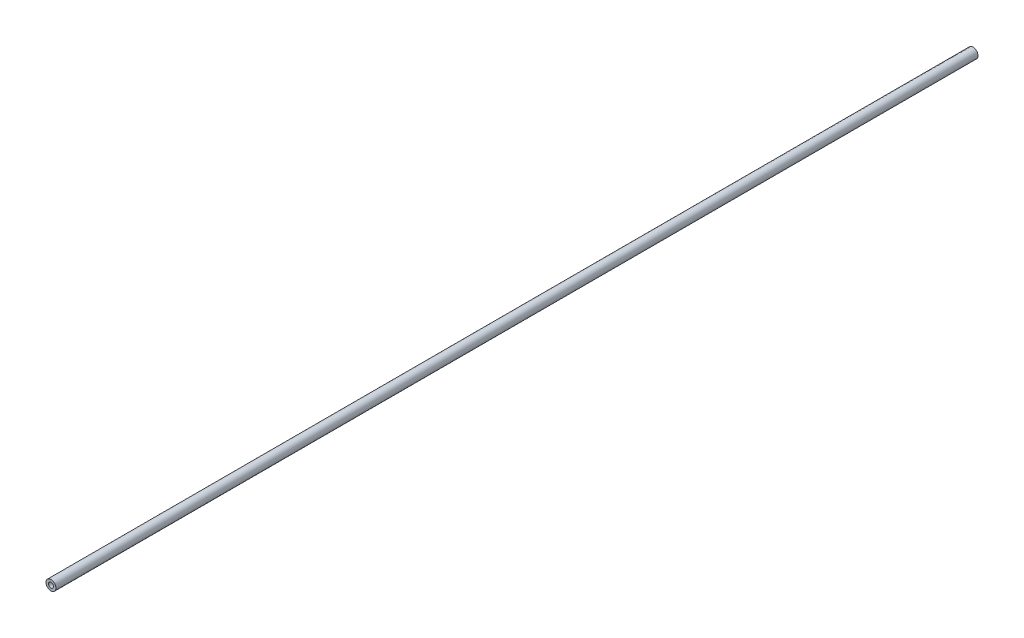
ISO-10303-21;
HEADER;
FILE_DESCRIPTION(('STEP AP214'),'2;1');
FILE_NAME('part.step','',(''),(''),'','','');
FILE_SCHEMA(('AUTOMOTIVE_DESIGN { 1 0 10303 214 1 1 1 1 }'));
ENDSEC;
DATA;
#1=APPLICATION_CONTEXT('core data for automotive mechanical design processes');
#2=APPLICATION_PROTOCOL_DEFINITION('international standard','automotive_design',2000,#1);
#3=PRODUCT_CONTEXT('',#1,'mechanical');
#4=PRODUCT('Part','Part','',(#3));
#5=PRODUCT_RELATED_PRODUCT_CATEGORY('part','',(#4));
#6=PRODUCT_DEFINITION_FORMATION('','',#4);
#7=PRODUCT_DEFINITION_CONTEXT('part definition',#1,'design');
#8=PRODUCT_DEFINITION('design','',#6,#7);
#9=PRODUCT_DEFINITION_SHAPE('','',#8);
#10=(LENGTH_UNIT() NAMED_UNIT(*) SI_UNIT(.MILLI.,.METRE.));
#11=(NAMED_UNIT(*) PLANE_ANGLE_UNIT() SI_UNIT($,.RADIAN.));
#12=(NAMED_UNIT(*) SI_UNIT($,.STERADIAN.) SOLID_ANGLE_UNIT());
#13=UNCERTAINTY_MEASURE_WITH_UNIT(LENGTH_MEASURE(1.E-05),#10,'distance_accuracy_value','');
#14=(GEOMETRIC_REPRESENTATION_CONTEXT(3) GLOBAL_UNCERTAINTY_ASSIGNED_CONTEXT((#13)) GLOBAL_UNIT_ASSIGNED_CONTEXT((#10,
#11,#12)) REPRESENTATION_CONTEXT('',''));
#15=CARTESIAN_POINT('',(0.,0.,0.));
#16=DIRECTION('',(0.,0.,1.));
#17=DIRECTION('',(1.,0.,0.));
#18=AXIS2_PLACEMENT_3D('',#15,#16,#17);
#19=CARTESIAN_POINT('',(0.,0.,463.8));
#20=DIRECTION('',(0.,0.,-1.));
#21=DIRECTION('',(-1.,0.,0.));
#22=AXIS2_PLACEMENT_3D('',#19,#20,#21);
#23=PLANE('',#22);
#24=CARTESIAN_POINT('',(0.,0.,463.8));
#25=DIRECTION('',(0.,0.,1.));
#26=DIRECTION('',(1.,0.,0.));
#27=AXIS2_PLACEMENT_3D('',#24,#25,#26);
#28=CIRCLE('',#27,2.49999999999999);
#29=CARTESIAN_POINT('',(2.49999999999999,0.,463.8));
#30=VERTEX_POINT('',#29);
#31=EDGE_CURVE('E56',#30,#30,#28,.T.);
#32=ORIENTED_EDGE('',*,*,#31,.F.);
#33=EDGE_LOOP('',(#32));
#34=FACE_BOUND('',#33,.T.);
#35=CARTESIAN_POINT('',(0.,0.,463.8));
#36=DIRECTION('',(0.,0.,1.));
#37=DIRECTION('',(1.,0.,0.));
#38=AXIS2_PLACEMENT_3D('',#35,#36,#37);
#39=CIRCLE('',#38,5.);
#40=CARTESIAN_POINT('',(5.,0.,463.8));
#41=VERTEX_POINT('',#40);
#42=EDGE_CURVE('E11',#41,#41,#39,.T.);
#43=ORIENTED_EDGE('',*,*,#42,.T.);
#44=EDGE_LOOP('',(#43));
#45=FACE_BOUND('',#44,.T.);
#46=ADVANCED_FACE('F32',(#34,#45),#23,.F.);
#47=CARTESIAN_POINT('',(0.,0.,463.8));
#48=DIRECTION('',(0.,0.,1.));
#49=DIRECTION('',(1.,0.,0.));
#50=AXIS2_PLACEMENT_3D('',#47,#48,#49);
#51=CYLINDRICAL_SURFACE('',#50,5.);
#52=CARTESIAN_POINT('',(0.,0.,-463.8));
#53=DIRECTION('',(0.,0.,1.));
#54=DIRECTION('',(1.,0.,0.));
#55=AXIS2_PLACEMENT_3D('',#52,#53,#54);
#56=CIRCLE('',#55,5.);
#57=CARTESIAN_POINT('',(5.,0.,-463.8));
#58=VERTEX_POINT('',#57);
#59=EDGE_CURVE('E39',#58,#58,#56,.T.);
#60=CARTESIAN_POINT('',(5.,0.,463.8));
#61=CARTESIAN_POINT('',(5.,0.,454.1375));
#62=CARTESIAN_POINT('',(5.,0.,444.475));
#63=CARTESIAN_POINT('',(5.,0.,425.15));
#64=CARTESIAN_POINT('',(5.,0.,415.4875));
#65=CARTESIAN_POINT('',(5.,0.,396.1625));
#66=CARTESIAN_POINT('',(5.,0.,386.5));
#67=CARTESIAN_POINT('',(5.,0.,367.175));
#68=CARTESIAN_POINT('',(5.,0.,357.5125));
#69=CARTESIAN_POINT('',(5.,0.,338.1875));
#70=CARTESIAN_POINT('',(5.,0.,328.525));
#71=CARTESIAN_POINT('',(5.,0.,309.2));
#72=CARTESIAN_POINT('',(5.,0.,299.5375));
#73=CARTESIAN_POINT('',(5.,0.,280.2125));
#74=CARTESIAN_POINT('',(5.,0.,270.55));
#75=CARTESIAN_POINT('',(5.,0.,251.225));
#76=CARTESIAN_POINT('',(5.,0.,241.5625));
#77=CARTESIAN_POINT('',(5.,0.,222.2375));
#78=CARTESIAN_POINT('',(5.,0.,212.575));
#79=CARTESIAN_POINT('',(5.,0.,193.25));
#80=CARTESIAN_POINT('',(5.,0.,183.5875));
#81=CARTESIAN_POINT('',(5.,0.,164.2625));
#82=CARTESIAN_POINT('',(5.,0.,154.6));
#83=CARTESIAN_POINT('',(5.,0.,135.275));
#84=CARTESIAN_POINT('',(5.,0.,125.6125));
#85=CARTESIAN_POINT('',(5.,0.,106.2875));
#86=CARTESIAN_POINT('',(5.,0.,96.6249999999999));
#87=CARTESIAN_POINT('',(5.,0.,77.2999999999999));
#88=CARTESIAN_POINT('',(5.,0.,67.6374999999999));
#89=CARTESIAN_POINT('',(5.,0.,48.3124999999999));
#90=CARTESIAN_POINT('',(5.,0.,38.6499999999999));
#91=CARTESIAN_POINT('',(5.,0.,19.3249999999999));
#92=CARTESIAN_POINT('',(5.,0.,9.66249999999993));
#93=CARTESIAN_POINT('',(5.,0.,-9.66250000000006));
#94=CARTESIAN_POINT('',(5.,0.,-19.3250000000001));
#95=CARTESIAN_POINT('',(5.,0.,-38.65));
#96=CARTESIAN_POINT('',(5.,0.,-48.3125));
#97=CARTESIAN_POINT('',(5.,0.,-67.6375));
#98=CARTESIAN_POINT('',(5.,0.,-77.3));
#99=CARTESIAN_POINT('',(5.,0.,-96.625));
#100=CARTESIAN_POINT('',(5.,0.,-106.2875));
#101=CARTESIAN_POINT('',(5.,0.,-125.6125));
#102=CARTESIAN_POINT('',(5.,0.,-135.275));
#103=CARTESIAN_POINT('',(5.,0.,-154.6));
#104=CARTESIAN_POINT('',(5.,0.,-164.2625));
#105=CARTESIAN_POINT('',(5.,0.,-183.5875));
#106=CARTESIAN_POINT('',(5.,0.,-193.25));
#107=CARTESIAN_POINT('',(5.,0.,-212.575));
#108=CARTESIAN_POINT('',(5.,0.,-222.2375));
#109=CARTESIAN_POINT('',(5.,0.,-241.5625));
#110=CARTESIAN_POINT('',(5.,0.,-251.225));
#111=CARTESIAN_POINT('',(5.,0.,-270.55));
#112=CARTESIAN_POINT('',(5.,0.,-280.2125));
#113=CARTESIAN_POINT('',(5.,0.,-299.5375));
#114=CARTESIAN_POINT('',(5.,0.,-309.2));
#115=CARTESIAN_POINT('',(5.,0.,-328.525));
#116=CARTESIAN_POINT('',(5.,0.,-338.1875));
#117=CARTESIAN_POINT('',(5.,0.,-357.5125));
#118=CARTESIAN_POINT('',(5.,0.,-367.175));
#119=CARTESIAN_POINT('',(5.,0.,-386.5));
#120=CARTESIAN_POINT('',(5.,0.,-396.1625));
#121=CARTESIAN_POINT('',(5.,0.,-415.4875));
#122=CARTESIAN_POINT('',(5.,0.,-425.15));
#123=CARTESIAN_POINT('',(5.,0.,-444.475));
#124=CARTESIAN_POINT('',(5.,0.,-454.1375));
#125=CARTESIAN_POINT('',(5.,0.,-463.8));
#126=B_SPLINE_CURVE_WITH_KNOTS('',3,(#60,#61,#62,#63,#64,#65,#66,#67,#68,#69,#70,#71,#72,#73,
#74,#75,#76,#77,#78,#79,#80,#81,#82,#83,#84,#85,#86,#87,#88,#89,#90,#91,#92,#93,#94,#95,#96,#97,
#98,#99,#100,#101,#102,#103,#104,#105,#106,#107,#108,#109,#110,#111,#112,#113,#114,#115,#116,
#117,#118,#119,#120,#121,#122,#123,#124,#125),.UNSPECIFIED.,.F.,.F.,(4,2,2,2,2,2,2,2,2,2,2,2,2,
2,2,2,2,2,2,2,2,2,2,2,2,2,2,2,2,2,2,2,4),(0.,28.9874999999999,57.9749999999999,86.9624999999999,
115.95,144.9375,173.925,202.9125,231.9,260.8875,289.875,318.8625,347.85,376.8375,405.825,
434.8125,463.8,492.7875,521.775,550.7625,579.75,608.7375,637.725,666.7125,695.7,
724.687499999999,753.674999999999,782.6625,811.65,840.637499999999,869.625,898.612499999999,
927.599999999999),.UNSPECIFIED.);
#127=EDGE_CURVE('BSEAM68',#41,#58,#126,.T.);
#128=ORIENTED_EDGE('',*,*,#42,.F.);
#129=ORIENTED_EDGE('',*,*,#59,.T.);
#130=ORIENTED_EDGE('',*,*,#127,.T.);
#131=ORIENTED_EDGE('',*,*,#127,.F.);
#132=EDGE_LOOP('',(#128,#130,#129,#131));
#133=FACE_BOUND('',#132,.T.);
#134=ADVANCED_FACE('F68',(#133),#51,.T.);
#135=CARTESIAN_POINT('',(0.,0.,-463.8));
#136=DIRECTION('',(0.,0.,1.));
#137=DIRECTION('',(1.,0.,0.));
#138=AXIS2_PLACEMENT_3D('',#135,#136,#137);
#139=PLANE('',#138);
#140=CARTESIAN_POINT('',(0.,0.,-463.8));
#141=DIRECTION('',(0.,0.,-1.));
#142=DIRECTION('',(-1.,0.,0.));
#143=AXIS2_PLACEMENT_3D('',#140,#141,#142);
#144=CIRCLE('',#143,2.49999999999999);
#145=CARTESIAN_POINT('',(-2.49999999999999,0.,-463.8));
#146=VERTEX_POINT('',#145);
#147=EDGE_CURVE('E55',#146,#146,#144,.T.);
#148=ORIENTED_EDGE('',*,*,#147,.F.);
#149=EDGE_LOOP('',(#148));
#150=FACE_BOUND('',#149,.T.);
#151=ORIENTED_EDGE('',*,*,#59,.F.);
#152=EDGE_LOOP('',(#151));
#153=FACE_BOUND('',#152,.T.);
#154=ADVANCED_FACE('F70',(#150,#153),#139,.F.);
#155=CARTESIAN_POINT('',(0.,0.,-446.8));
#156=DIRECTION('',(0.,0.,-1.));
#157=DIRECTION('',(-1.,0.,0.));
#158=AXIS2_PLACEMENT_3D('',#155,#156,#157);
#159=CONICAL_SURFACE('',#158,2.49999999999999,1.02974425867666);
#160=CARTESIAN_POINT('',(0.,0.,-445.297848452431));
#161=VERTEX_POINT('',#160);
#162=VERTEX_LOOP('',#161);
#163=FACE_BOUND('',#162,.T.);
#164=CARTESIAN_POINT('',(0.,0.,-446.8));
#165=DIRECTION('',(0.,0.,-1.));
#166=DIRECTION('',(-1.,0.,0.));
#167=AXIS2_PLACEMENT_3D('',#164,#165,#166);
#168=CIRCLE('',#167,2.49999999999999);
#169=CARTESIAN_POINT('',(-2.49999999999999,0.,-446.8));
#170=VERTEX_POINT('',#169);
#171=EDGE_CURVE('E59',#170,#170,#168,.T.);
#172=ORIENTED_EDGE('',*,*,#171,.T.);
#173=EDGE_LOOP('',(#172));
#174=FACE_BOUND('',#173,.T.);
#175=ADVANCED_FACE('F72',(#163,#174),#159,.F.);
#176=CARTESIAN_POINT('',(0.,0.,-463.8));
#177=DIRECTION('',(0.,0.,-1.));
#178=DIRECTION('',(-1.,0.,0.));
#179=AXIS2_PLACEMENT_3D('',#176,#177,#178);
#180=CYLINDRICAL_SURFACE('',#179,2.49999999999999);
#181=CARTESIAN_POINT('',(-2.49999999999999,0.,-446.8));
#182=CARTESIAN_POINT('',(-2.49999999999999,0.,-446.977083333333));
#183=CARTESIAN_POINT('',(-2.49999999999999,0.,-447.154166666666));
#184=CARTESIAN_POINT('',(-2.49999999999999,0.,-447.508333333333));
#185=CARTESIAN_POINT('',(-2.49999999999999,0.,-447.685416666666));
#186=CARTESIAN_POINT('',(-2.49999999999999,0.,-448.039583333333));
#187=CARTESIAN_POINT('',(-2.49999999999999,0.,-448.216666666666));
#188=CARTESIAN_POINT('',(-2.49999999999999,0.,-448.570833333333));
#189=CARTESIAN_POINT('',(-2.49999999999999,0.,-448.747916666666));
#190=CARTESIAN_POINT('',(-2.49999999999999,0.,-449.102083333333));
#191=CARTESIAN_POINT('',(-2.49999999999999,0.,-449.279166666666));
#192=CARTESIAN_POINT('',(-2.49999999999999,0.,-449.633333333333));
#193=CARTESIAN_POINT('',(-2.49999999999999,0.,-449.810416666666));
#194=CARTESIAN_POINT('',(-2.49999999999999,0.,-450.164583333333));
#195=CARTESIAN_POINT('',(-2.49999999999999,0.,-450.341666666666));
#196=CARTESIAN_POINT('',(-2.49999999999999,0.,-450.695833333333));
#197=CARTESIAN_POINT('',(-2.49999999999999,0.,-450.872916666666));
#198=CARTESIAN_POINT('',(-2.49999999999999,0.,-451.227083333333));
#199=CARTESIAN_POINT('',(-2.49999999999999,0.,-451.404166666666));
#200=CARTESIAN_POINT('',(-2.49999999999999,0.,-451.758333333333));
#201=CARTESIAN_POINT('',(-2.49999999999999,0.,-451.935416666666));
#202=CARTESIAN_POINT('',(-2.49999999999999,0.,-452.289583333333));
#203=CARTESIAN_POINT('',(-2.49999999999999,0.,-452.466666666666));
#204=CARTESIAN_POINT('',(-2.49999999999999,0.,-452.820833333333));
#205=CARTESIAN_POINT('',(-2.49999999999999,0.,-452.997916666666));
#206=CARTESIAN_POINT('',(-2.49999999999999,0.,-453.352083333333));
#207=CARTESIAN_POINT('',(-2.49999999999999,0.,-453.529166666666));
#208=CARTESIAN_POINT('',(-2.49999999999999,0.,-453.883333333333));
#209=CARTESIAN_POINT('',(-2.49999999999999,0.,-454.060416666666));
#210=CARTESIAN_POINT('',(-2.49999999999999,0.,-454.414583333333));
#211=CARTESIAN_POINT('',(-2.49999999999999,0.,-454.591666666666));
#212=CARTESIAN_POINT('',(-2.49999999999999,0.,-454.945833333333));
#213=CARTESIAN_POINT('',(-2.49999999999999,0.,-455.122916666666));
#214=CARTESIAN_POINT('',(-2.49999999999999,0.,-455.477083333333));
#215=CARTESIAN_POINT('',(-2.49999999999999,0.,-455.654166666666));
#216=CARTESIAN_POINT('',(-2.49999999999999,0.,-456.008333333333));
#217=CARTESIAN_POINT('',(-2.49999999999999,0.,-456.185416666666));
#218=CARTESIAN_POINT('',(-2.49999999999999,0.,-456.539583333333));
#219=CARTESIAN_POINT('',(-2.49999999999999,0.,-456.716666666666));
#220=CARTESIAN_POINT('',(-2.49999999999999,0.,-457.070833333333));
#221=CARTESIAN_POINT('',(-2.49999999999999,0.,-457.247916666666));
#222=CARTESIAN_POINT('',(-2.49999999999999,0.,-457.602083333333));
#223=CARTESIAN_POINT('',(-2.49999999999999,0.,-457.779166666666));
#224=CARTESIAN_POINT('',(-2.49999999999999,0.,-458.133333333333));
#225=CARTESIAN_POINT('',(-2.49999999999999,0.,-458.310416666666));
#226=CARTESIAN_POINT('',(-2.49999999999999,0.,-458.664583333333));
#227=CARTESIAN_POINT('',(-2.49999999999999,0.,-458.841666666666));
#228=CARTESIAN_POINT('',(-2.49999999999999,0.,-459.195833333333));
#229=CARTESIAN_POINT('',(-2.49999999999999,0.,-459.372916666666));
#230=CARTESIAN_POINT('',(-2.49999999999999,0.,-459.727083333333));
#231=CARTESIAN_POINT('',(-2.49999999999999,0.,-459.904166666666));
#232=CARTESIAN_POINT('',(-2.49999999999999,0.,-460.258333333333));
#233=CARTESIAN_POINT('',(-2.49999999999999,0.,-460.435416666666));
#234=CARTESIAN_POINT('',(-2.49999999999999,0.,-460.789583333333));
#235=CARTESIAN_POINT('',(-2.49999999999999,0.,-460.966666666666));
#236=CARTESIAN_POINT('',(-2.49999999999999,0.,-461.320833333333));
#237=CARTESIAN_POINT('',(-2.49999999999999,0.,-461.497916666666));
#238=CARTESIAN_POINT('',(-2.49999999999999,0.,-461.852083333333));
#239=CARTESIAN_POINT('',(-2.49999999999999,0.,-462.029166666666));
#240=CARTESIAN_POINT('',(-2.49999999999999,0.,-462.383333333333));
#241=CARTESIAN_POINT('',(-2.49999999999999,0.,-462.560416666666));
#242=CARTESIAN_POINT('',(-2.49999999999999,0.,-462.914583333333));
#243=CARTESIAN_POINT('',(-2.49999999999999,0.,-463.091666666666));
#244=CARTESIAN_POINT('',(-2.49999999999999,0.,-463.445833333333));
#245=CARTESIAN_POINT('',(-2.49999999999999,0.,-463.622916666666));
#246=CARTESIAN_POINT('',(-2.49999999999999,0.,-463.8));
#247=B_SPLINE_CURVE_WITH_KNOTS('',3,(#181,#182,#183,#184,#185,#186,#187,#188,#189,#190,#191,
#192,#193,#194,#195,#196,#197,#198,#199,#200,#201,#202,#203,#204,#205,#206,#207,#208,#209,#210,
#211,#212,#213,#214,#215,#216,#217,#218,#219,#220,#221,#222,#223,#224,#225,#226,#227,#228,#229,
#230,#231,#232,#233,#234,#235,#236,#237,#238,#239,#240,#241,#242,#243,#244,#245,#246),
.UNSPECIFIED.,.F.,.F.,(4,2,2,2,2,2,2,2,2,2,2,2,2,2,2,2,2,2,2,2,2,2,2,2,2,2,2,2,2,2,2,2,4),(0.,
0.531249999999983,1.06249999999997,1.59374999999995,2.12499999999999,2.65624999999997,
3.18749999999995,3.71874999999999,4.24999999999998,4.78124999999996,5.3125,5.84374999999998,
6.37499999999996,6.90625,7.43749999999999,7.96874999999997,8.49999999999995,9.03124999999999,
9.56249999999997,10.09375,10.625,11.15625,11.6875,12.21875,12.75,13.28125,13.8125,14.34375,
14.875,15.40625,15.9375,16.46875,17.),.UNSPECIFIED.);
#248=EDGE_CURVE('BSEAM49',#170,#146,#247,.T.);
#249=ORIENTED_EDGE('',*,*,#171,.F.);
#250=ORIENTED_EDGE('',*,*,#147,.T.);
#251=ORIENTED_EDGE('',*,*,#248,.T.);
#252=ORIENTED_EDGE('',*,*,#248,.F.);
#253=EDGE_LOOP('',(#249,#251,#250,#252));
#254=FACE_BOUND('',#253,.T.);
#255=ADVANCED_FACE('F49',(#254),#180,.F.);
#256=CARTESIAN_POINT('',(0.,0.,446.8));
#257=DIRECTION('',(0.,0.,1.));
#258=DIRECTION('',(1.,0.,0.));
#259=AXIS2_PLACEMENT_3D('',#256,#257,#258);
#260=CONICAL_SURFACE('',#259,2.49999999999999,1.02974425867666);
#261=CARTESIAN_POINT('',(0.,0.,445.297848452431));
#262=VERTEX_POINT('',#261);
#263=VERTEX_LOOP('',#262);
#264=FACE_BOUND('',#263,.T.);
#265=CARTESIAN_POINT('',(0.,0.,446.8));
#266=DIRECTION('',(0.,0.,1.));
#267=DIRECTION('',(1.,0.,0.));
#268=AXIS2_PLACEMENT_3D('',#265,#266,#267);
#269=CIRCLE('',#268,2.49999999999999);
#270=CARTESIAN_POINT('',(2.49999999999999,0.,446.8));
#271=VERTEX_POINT('',#270);
#272=EDGE_CURVE('E53',#271,#271,#269,.T.);
#273=ORIENTED_EDGE('',*,*,#272,.T.);
#274=EDGE_LOOP('',(#273));
#275=FACE_BOUND('',#274,.T.);
#276=ADVANCED_FACE('F45',(#264,#275),#260,.F.);
#277=CARTESIAN_POINT('',(0.,0.,463.8));
#278=DIRECTION('',(0.,0.,1.));
#279=DIRECTION('',(1.,0.,0.));
#280=AXIS2_PLACEMENT_3D('',#277,#278,#279);
#281=CYLINDRICAL_SURFACE('',#280,2.49999999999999);
#282=CARTESIAN_POINT('',(2.49999999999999,0.,446.8));
#283=CARTESIAN_POINT('',(2.49999999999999,0.,446.977083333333));
#284=CARTESIAN_POINT('',(2.49999999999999,0.,447.154166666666));
#285=CARTESIAN_POINT('',(2.49999999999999,0.,447.508333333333));
#286=CARTESIAN_POINT('',(2.49999999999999,0.,447.685416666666));
#287=CARTESIAN_POINT('',(2.49999999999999,0.,448.039583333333));
#288=CARTESIAN_POINT('',(2.49999999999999,0.,448.216666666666));
#289=CARTESIAN_POINT('',(2.49999999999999,0.,448.570833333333));
#290=CARTESIAN_POINT('',(2.49999999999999,0.,448.747916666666));
#291=CARTESIAN_POINT('',(2.49999999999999,0.,449.102083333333));
#292=CARTESIAN_POINT('',(2.49999999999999,0.,449.279166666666));
#293=CARTESIAN_POINT('',(2.49999999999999,0.,449.633333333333));
#294=CARTESIAN_POINT('',(2.49999999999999,0.,449.810416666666));
#295=CARTESIAN_POINT('',(2.49999999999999,0.,450.164583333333));
#296=CARTESIAN_POINT('',(2.49999999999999,0.,450.341666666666));
#297=CARTESIAN_POINT('',(2.49999999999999,0.,450.695833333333));
#298=CARTESIAN_POINT('',(2.49999999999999,0.,450.872916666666));
#299=CARTESIAN_POINT('',(2.49999999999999,0.,451.227083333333));
#300=CARTESIAN_POINT('',(2.49999999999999,0.,451.404166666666));
#301=CARTESIAN_POINT('',(2.49999999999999,0.,451.758333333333));
#302=CARTESIAN_POINT('',(2.49999999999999,0.,451.935416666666));
#303=CARTESIAN_POINT('',(2.49999999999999,0.,452.289583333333));
#304=CARTESIAN_POINT('',(2.49999999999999,0.,452.466666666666));
#305=CARTESIAN_POINT('',(2.49999999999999,0.,452.820833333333));
#306=CARTESIAN_POINT('',(2.49999999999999,0.,452.997916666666));
#307=CARTESIAN_POINT('',(2.49999999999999,0.,453.352083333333));
#308=CARTESIAN_POINT('',(2.49999999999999,0.,453.529166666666));
#309=CARTESIAN_POINT('',(2.49999999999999,0.,453.883333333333));
#310=CARTESIAN_POINT('',(2.49999999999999,0.,454.060416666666));
#311=CARTESIAN_POINT('',(2.49999999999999,0.,454.414583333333));
#312=CARTESIAN_POINT('',(2.49999999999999,0.,454.591666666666));
#313=CARTESIAN_POINT('',(2.49999999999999,0.,454.945833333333));
#314=CARTESIAN_POINT('',(2.49999999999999,0.,455.122916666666));
#315=CARTESIAN_POINT('',(2.49999999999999,0.,455.477083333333));
#316=CARTESIAN_POINT('',(2.49999999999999,0.,455.654166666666));
#317=CARTESIAN_POINT('',(2.49999999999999,0.,456.008333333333));
#318=CARTESIAN_POINT('',(2.49999999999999,0.,456.185416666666));
#319=CARTESIAN_POINT('',(2.49999999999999,0.,456.539583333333));
#320=CARTESIAN_POINT('',(2.49999999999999,0.,456.716666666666));
#321=CARTESIAN_POINT('',(2.49999999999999,0.,457.070833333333));
#322=CARTESIAN_POINT('',(2.49999999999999,0.,457.247916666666));
#323=CARTESIAN_POINT('',(2.49999999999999,0.,457.602083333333));
#324=CARTESIAN_POINT('',(2.49999999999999,0.,457.779166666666));
#325=CARTESIAN_POINT('',(2.49999999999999,0.,458.133333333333));
#326=CARTESIAN_POINT('',(2.49999999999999,0.,458.310416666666));
#327=CARTESIAN_POINT('',(2.49999999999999,0.,458.664583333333));
#328=CARTESIAN_POINT('',(2.49999999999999,0.,458.841666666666));
#329=CARTESIAN_POINT('',(2.49999999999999,0.,459.195833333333));
#330=CARTESIAN_POINT('',(2.49999999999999,0.,459.372916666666));
#331=CARTESIAN_POINT('',(2.49999999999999,0.,459.727083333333));
#332=CARTESIAN_POINT('',(2.49999999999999,0.,459.904166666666));
#333=CARTESIAN_POINT('',(2.49999999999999,0.,460.258333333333));
#334=CARTESIAN_POINT('',(2.49999999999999,0.,460.435416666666));
#335=CARTESIAN_POINT('',(2.49999999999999,0.,460.789583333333));
#336=CARTESIAN_POINT('',(2.49999999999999,0.,460.966666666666));
#337=CARTESIAN_POINT('',(2.49999999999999,0.,461.320833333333));
#338=CARTESIAN_POINT('',(2.49999999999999,0.,461.497916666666));
#339=CARTESIAN_POINT('',(2.49999999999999,0.,461.852083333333));
#340=CARTESIAN_POINT('',(2.49999999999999,0.,462.029166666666));
#341=CARTESIAN_POINT('',(2.49999999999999,0.,462.383333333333));
#342=CARTESIAN_POINT('',(2.49999999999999,0.,462.560416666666));
#343=CARTESIAN_POINT('',(2.49999999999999,0.,462.914583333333));
#344=CARTESIAN_POINT('',(2.49999999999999,0.,463.091666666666));
#345=CARTESIAN_POINT('',(2.49999999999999,0.,463.445833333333));
#346=CARTESIAN_POINT('',(2.49999999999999,0.,463.622916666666));
#347=CARTESIAN_POINT('',(2.49999999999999,0.,463.8));
#348=B_SPLINE_CURVE_WITH_KNOTS('',3,(#282,#283,#284,#285,#286,#287,#288,#289,#290,#291,#292,
#293,#294,#295,#296,#297,#298,#299,#300,#301,#302,#303,#304,#305,#306,#307,#308,#309,#310,#311,
#312,#313,#314,#315,#316,#317,#318,#319,#320,#321,#322,#323,#324,#325,#326,#327,#328,#329,#330,
#331,#332,#333,#334,#335,#336,#337,#338,#339,#340,#341,#342,#343,#344,#345,#346,#347),
.UNSPECIFIED.,.F.,.F.,(4,2,2,2,2,2,2,2,2,2,2,2,2,2,2,2,2,2,2,2,2,2,2,2,2,2,2,2,2,2,2,2,4),(0.,
0.531249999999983,1.06249999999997,1.59374999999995,2.12499999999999,2.65624999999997,
3.18749999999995,3.71874999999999,4.24999999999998,4.78124999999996,5.3125,5.84374999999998,
6.37499999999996,6.90625,7.43749999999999,7.96874999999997,8.49999999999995,9.03124999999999,
9.56249999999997,10.09375,10.625,11.15625,11.6875,12.21875,12.75,13.28125,13.8125,14.34375,
14.875,15.40625,15.9375,16.46875,17.),.UNSPECIFIED.);
#349=EDGE_CURVE('BSEAM48',#271,#30,#348,.T.);
#350=ORIENTED_EDGE('',*,*,#272,.F.);
#351=ORIENTED_EDGE('',*,*,#31,.T.);
#352=ORIENTED_EDGE('',*,*,#349,.T.);
#353=ORIENTED_EDGE('',*,*,#349,.F.);
#354=EDGE_LOOP('',(#350,#352,#351,#353));
#355=FACE_BOUND('',#354,.T.);
#356=ADVANCED_FACE('F48',(#355),#281,.F.);
#357=CLOSED_SHELL('',(#46,#134,#154,#175,#255,#276,#356));
#358=MANIFOLD_SOLID_BREP('B2',#357);
#359=ADVANCED_BREP_SHAPE_REPRESENTATION('',(#18,#358),#14);
#360=SHAPE_DEFINITION_REPRESENTATION(#9,#359);
ENDSEC;
END-ISO-10303-21;
